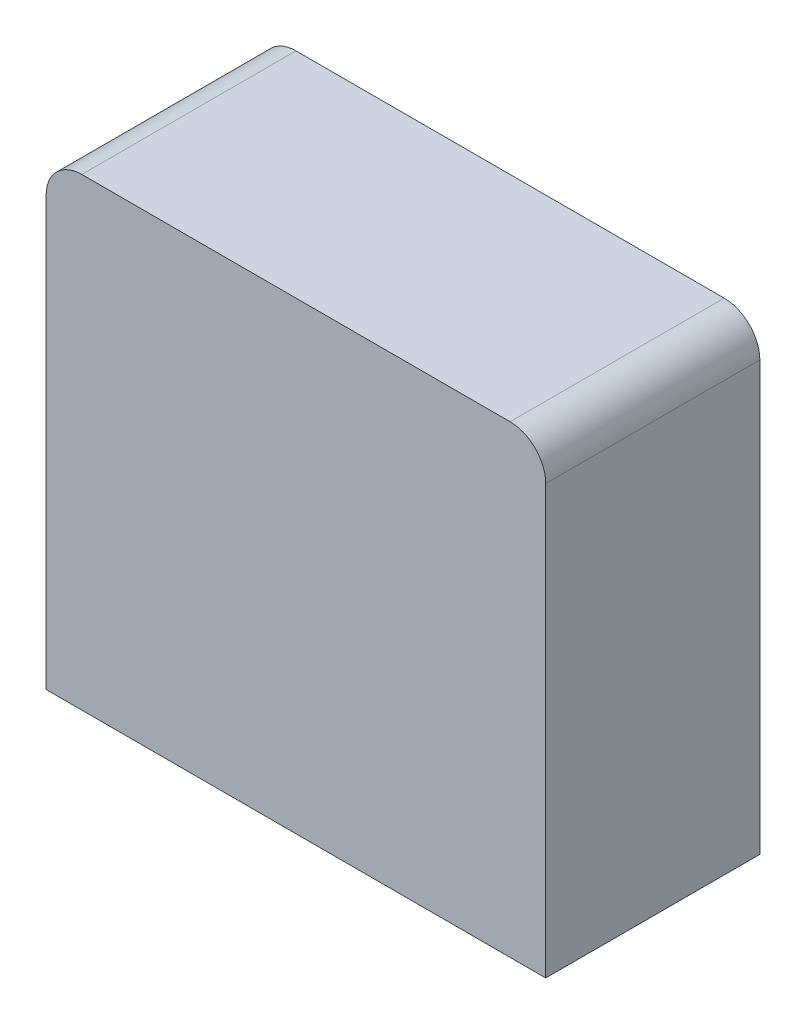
from build123d import *

# Parameters (mm, degrees)
SKETCH_1_W      = 14
SKETCH_1_H      = 6
SKETCH_1_R      = 1.6
EXTRUDE_1_DEPTH = 10
SKETCH_2_W      = 14
SKETCH_2_H      = 6
EXTRUDE_2_DEPTH = 3
FILLET_1_R      = 1


with BuildPart() as part:
    # Sketch 1 → Extrude 1 (new body)
    with BuildSketch(Plane(origin=(0, 0, 0), x_dir=(1, 0, 0), z_dir=(0, 1, 0))):
        with Locations((7, 3)):
            Rectangle(SKETCH_1_W, SKETCH_1_H)
        with Locations(Location((3, 3, 0), (0, 0, 270))):
            Circle(SKETCH_1_R, mode=Mode.SUBTRACT)
        with Locations(Location((11, 3, 0), (0, 0, 270))):
            Circle(SKETCH_1_R, mode=Mode.SUBTRACT)
    extrude(amount=EXTRUDE_1_DEPTH)

    # Sketch 2 → Extrude 2 (add)
    with BuildSketch(Plane(origin=(0, 10, 0), x_dir=(1, 0, 0), z_dir=(0, 1, 0))):
        with Locations((7, 3)):
            Rectangle(SKETCH_2_W, SKETCH_2_H)
    extrude(amount=EXTRUDE_2_DEPTH)

    # Fillet 1
    fillet_1_edges = [part.edges().sort_by_distance(p)[0] for p in [
        (0, 13, -3),
        (14, 13, -3),
    ]]
    fillet(fillet_1_edges, radius=FILLET_1_R)


solid = part.part
